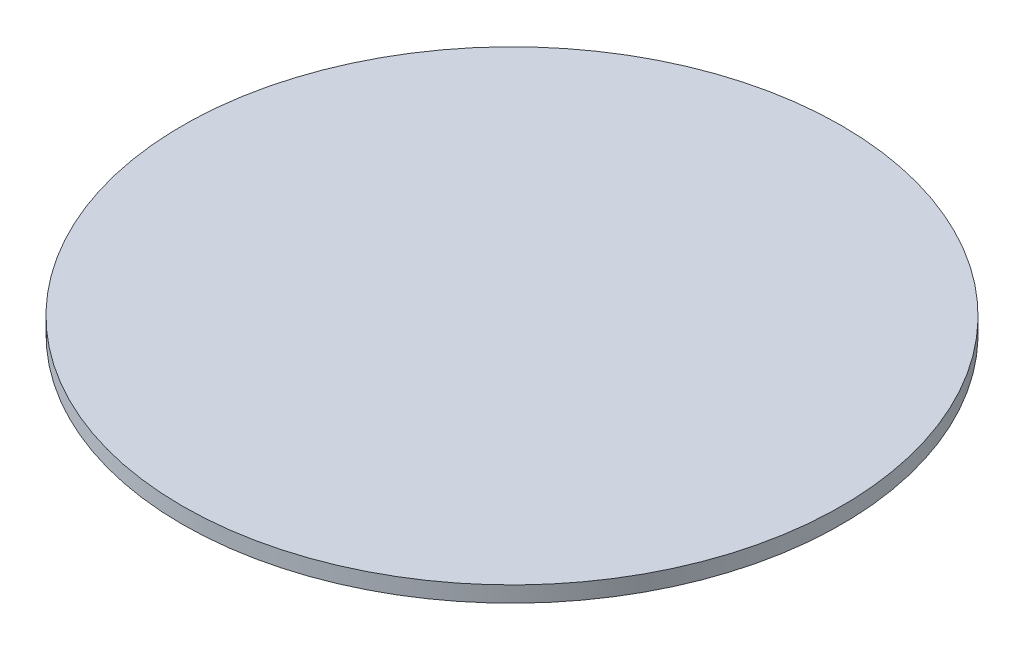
ISO-10303-21;
HEADER;
FILE_DESCRIPTION(('STEP AP214'),'2;1');
FILE_NAME('part.step','',(''),(''),'','','');
FILE_SCHEMA(('AUTOMOTIVE_DESIGN { 1 0 10303 214 1 1 1 1 }'));
ENDSEC;
DATA;
#1=APPLICATION_CONTEXT('core data for automotive mechanical design processes');
#2=APPLICATION_PROTOCOL_DEFINITION('international standard','automotive_design',2000,#1);
#3=PRODUCT_CONTEXT('',#1,'mechanical');
#4=PRODUCT('Part','Part','',(#3));
#5=PRODUCT_RELATED_PRODUCT_CATEGORY('part','',(#4));
#6=PRODUCT_DEFINITION_FORMATION('','',#4);
#7=PRODUCT_DEFINITION_CONTEXT('part definition',#1,'design');
#8=PRODUCT_DEFINITION('design','',#6,#7);
#9=PRODUCT_DEFINITION_SHAPE('','',#8);
#10=(LENGTH_UNIT() NAMED_UNIT(*) SI_UNIT(.MILLI.,.METRE.));
#11=(NAMED_UNIT(*) PLANE_ANGLE_UNIT() SI_UNIT($,.RADIAN.));
#12=(NAMED_UNIT(*) SI_UNIT($,.STERADIAN.) SOLID_ANGLE_UNIT());
#13=UNCERTAINTY_MEASURE_WITH_UNIT(LENGTH_MEASURE(1.E-05),#10,'distance_accuracy_value','');
#14=(GEOMETRIC_REPRESENTATION_CONTEXT(3) GLOBAL_UNCERTAINTY_ASSIGNED_CONTEXT((#13)) GLOBAL_UNIT_ASSIGNED_CONTEXT((#10,
#11,#12)) REPRESENTATION_CONTEXT('',''));
#15=CARTESIAN_POINT('',(0.,0.,0.));
#16=DIRECTION('',(0.,0.,1.));
#17=DIRECTION('',(1.,0.,0.));
#18=AXIS2_PLACEMENT_3D('',#15,#16,#17);
#19=CARTESIAN_POINT('',(0.,1.2445999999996,0.));
#20=DIRECTION('',(0.,-1.,0.));
#21=DIRECTION('',(0.,0.,-1.));
#22=AXIS2_PLACEMENT_3D('',#19,#20,#21);
#23=CYLINDRICAL_SURFACE('',#22,25.8953);
#24=CARTESIAN_POINT('',(0.,1.2445999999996,0.));
#25=DIRECTION('',(0.,1.,0.));
#26=DIRECTION('',(0.,0.,1.));
#27=AXIS2_PLACEMENT_3D('',#24,#25,#26);
#28=CIRCLE('',#27,25.8953);
#29=CARTESIAN_POINT('',(0.,1.2445999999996,25.8953));
#30=VERTEX_POINT('',#29);
#31=EDGE_CURVE('E12',#30,#30,#28,.T.);
#32=ORIENTED_EDGE('',*,*,#31,.F.);
#33=EDGE_LOOP('',(#32));
#34=FACE_BOUND('',#33,.T.);
#35=CARTESIAN_POINT('',(0.,0.,0.));
#36=DIRECTION('',(0.,1.,0.));
#37=DIRECTION('',(0.,0.,1.));
#38=AXIS2_PLACEMENT_3D('',#35,#36,#37);
#39=CIRCLE('',#38,25.8953);
#40=CARTESIAN_POINT('',(0.,0.,25.8953));
#41=VERTEX_POINT('',#40);
#42=EDGE_CURVE('E43',#41,#41,#39,.T.);
#43=ORIENTED_EDGE('',*,*,#42,.T.);
#44=EDGE_LOOP('',(#43));
#45=FACE_BOUND('',#44,.T.);
#46=ADVANCED_FACE('F40',(#34,#45),#23,.T.);
#47=CARTESIAN_POINT('',(0.,1.2445999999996,0.));
#48=DIRECTION('',(0.,1.,0.));
#49=DIRECTION('',(0.,0.,1.));
#50=AXIS2_PLACEMENT_3D('',#47,#48,#49);
#51=PLANE('',#50);
#52=ORIENTED_EDGE('',*,*,#31,.T.);
#53=EDGE_LOOP('',(#52));
#54=FACE_BOUND('',#53,.T.);
#55=ADVANCED_FACE('F55',(#54),#51,.T.);
#56=CARTESIAN_POINT('',(0.,0.,0.));
#57=DIRECTION('',(0.,1.,0.));
#58=DIRECTION('',(0.,0.,1.));
#59=AXIS2_PLACEMENT_3D('',#56,#57,#58);
#60=PLANE('',#59);
#61=ORIENTED_EDGE('',*,*,#42,.F.);
#62=EDGE_LOOP('',(#61));
#63=FACE_BOUND('',#62,.T.);
#64=ADVANCED_FACE('F53',(#63),#60,.F.);
#65=CLOSED_SHELL('',(#46,#55,#64));
#66=MANIFOLD_SOLID_BREP('B2',#65);
#67=ADVANCED_BREP_SHAPE_REPRESENTATION('',(#18,#66),#14);
#68=SHAPE_DEFINITION_REPRESENTATION(#9,#67);
ENDSEC;
END-ISO-10303-21;
